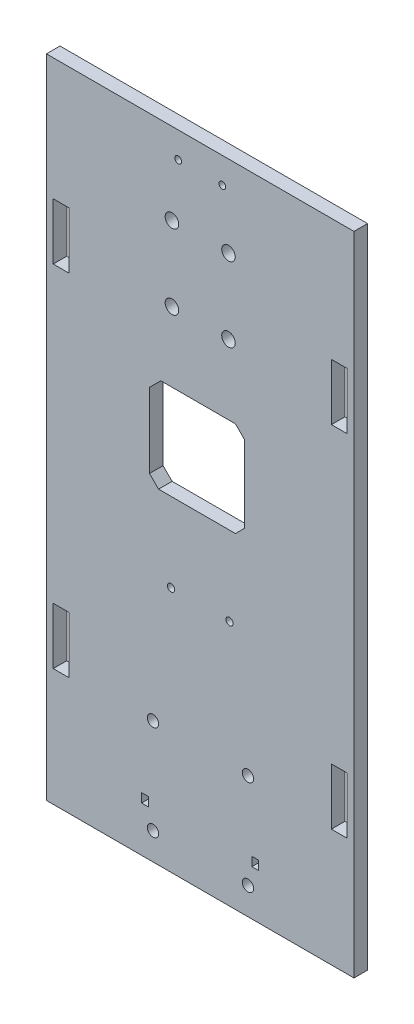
from build123d import *

# Parameters (mm, degrees)
SKETCH2_R           = 1.6
SKETCH2_R_2         = 3
SKETCH2_R_3         = 1.5
SKETCH2_R_4         = 2.5
SKETCH2_W           = 3
SKETCH2_H           = 4
SKETCH2_W_2         = 7
SKETCH2_H_2         = 25
BOSS_EXTRUDE1_DEPTH = 6


with BuildPart() as part:
    # Sketch2 → Boss-Extrude1 (new body)
    with BuildSketch(Plane.XY):
        Polygon((-77.268979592, 127.80760161), (-78.768979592, 127.80760161), (-78.768979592, -156.114540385), (-78.768979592, -158.114540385), (57.231020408, -158.114540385), (57.231020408, -156.114540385), (57.231020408, 127.80760161), (55.731020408, 127.80760161), align=None)
        with Locations((-23.668979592, -49.114540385)):
            Circle(SKETCH2_R, mode=Mode.SUBTRACT)
        with Locations((1.731020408, 91.738672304)):
            Circle(SKETCH2_R_2, mode=Mode.SUBTRACT)
        with Locations((-23.268979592, 58.738672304)):
            Circle(SKETCH2_R_2, mode=Mode.SUBTRACT)
        with Locations((2.186816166, -49.114540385)):
            Circle(SKETCH2_R, mode=Mode.SUBTRACT)
        with Locations((-20.487837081, 116.353108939)):
            Circle(SKETCH2_R_3, mode=Mode.SUBTRACT)
        with Locations((-0.987837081, 116.353108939)):
            Circle(SKETCH2_R_3, mode=Mode.SUBTRACT)
        with Locations((-31.648979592, -146.114540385)):
            Circle(SKETCH2_R_4, mode=Mode.SUBTRACT)
        with Locations((10.351020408, -146.114540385)):
            Circle(SKETCH2_R_4, mode=Mode.SUBTRACT)
        with Locations((-31.668236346, -104.080651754)):
            Circle(SKETCH2_R_4, mode=Mode.SUBTRACT)
        with Locations((10.32701242, -104.089530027)):
            Circle(SKETCH2_R_4, mode=Mode.SUBTRACT)
        with Locations((1.731020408, 58.738672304)):
            Circle(SKETCH2_R_2, mode=Mode.SUBTRACT)
        with Locations((-23.268979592, 91.738672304)):
            Circle(SKETCH2_R_2, mode=Mode.SUBTRACT)
        Polygon((-33.196425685, 22.885459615), (-33.196425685, -10.114540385), (-29.196425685, -14.114540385), (4.803574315, -14.114540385), (8.803574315, -10.114540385), (8.803574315, 23.885459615), (4.803574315, 27.885459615), (-28.196425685, 27.885459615), align=None, mode=Mode.SUBTRACT)
        with Locations((-35.216238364, -136.080416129)):
            Rectangle(SKETCH2_W, SKETCH2_H, mode=Mode.SUBTRACT)
        with Locations((13.551868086, -136.075480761)):
            Rectangle(SKETCH2_W, SKETCH2_H, mode=Mode.SUBTRACT)
        with Locations((50.731020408, -93.614540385)):
            Rectangle(SKETCH2_W_2, SKETCH2_H_2, mode=Mode.SUBTRACT)
        with Locations((50.731020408, 61.30760161)):
            Rectangle(SKETCH2_W_2, SKETCH2_H_2, mode=Mode.SUBTRACT)
        with Locations((-72.268979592, 61.30760161)):
            Rectangle(SKETCH2_W_2, SKETCH2_H_2, mode=Mode.SUBTRACT)
        with Locations((-72.268979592, -93.614540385)):
            Rectangle(SKETCH2_W_2, SKETCH2_H_2, mode=Mode.SUBTRACT)
    extrude(amount=BOSS_EXTRUDE1_DEPTH)


solid = part.part
